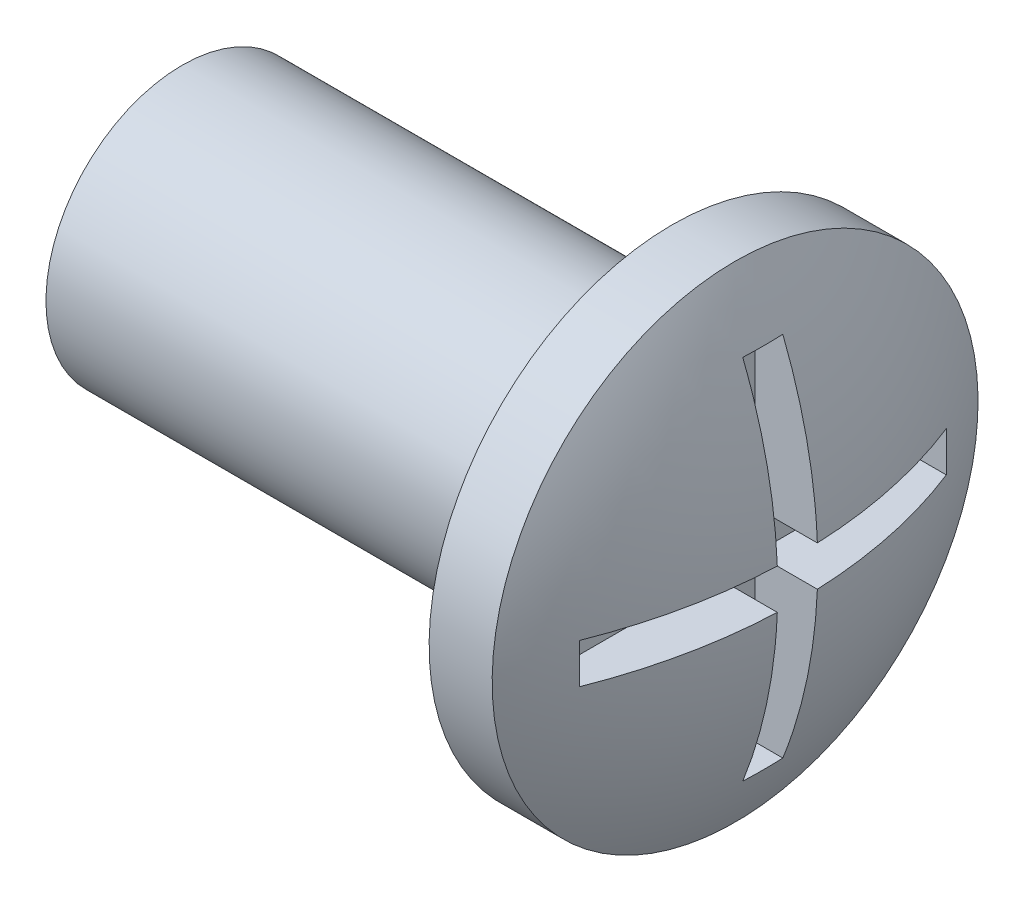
ISO-10303-21;
HEADER;
FILE_DESCRIPTION(('STEP AP214'),'2;1');
FILE_NAME('part.step','',(''),(''),'','','');
FILE_SCHEMA(('AUTOMOTIVE_DESIGN { 1 0 10303 214 1 1 1 1 }'));
ENDSEC;
DATA;
#1=APPLICATION_CONTEXT('core data for automotive mechanical design processes');
#2=APPLICATION_PROTOCOL_DEFINITION('international standard','automotive_design',2000,#1);
#3=PRODUCT_CONTEXT('',#1,'mechanical');
#4=PRODUCT('Part','Part','',(#3));
#5=PRODUCT_RELATED_PRODUCT_CATEGORY('part','',(#4));
#6=PRODUCT_DEFINITION_FORMATION('','',#4);
#7=PRODUCT_DEFINITION_CONTEXT('part definition',#1,'design');
#8=PRODUCT_DEFINITION('design','',#6,#7);
#9=PRODUCT_DEFINITION_SHAPE('','',#8);
#10=(LENGTH_UNIT() NAMED_UNIT(*) SI_UNIT(.MILLI.,.METRE.));
#11=(NAMED_UNIT(*) PLANE_ANGLE_UNIT() SI_UNIT($,.RADIAN.));
#12=(NAMED_UNIT(*) SI_UNIT($,.STERADIAN.) SOLID_ANGLE_UNIT());
#13=UNCERTAINTY_MEASURE_WITH_UNIT(LENGTH_MEASURE(1.E-05),#10,'distance_accuracy_value','');
#14=(GEOMETRIC_REPRESENTATION_CONTEXT(3) GLOBAL_UNCERTAINTY_ASSIGNED_CONTEXT((#13)) GLOBAL_UNIT_ASSIGNED_CONTEXT((#10,
#11,#12)) REPRESENTATION_CONTEXT('',''));
#15=CARTESIAN_POINT('',(0.,0.,0.));
#16=DIRECTION('',(0.,0.,1.));
#17=DIRECTION('',(1.,0.,0.));
#18=AXIS2_PLACEMENT_3D('',#15,#16,#17);
#19=CARTESIAN_POINT('',(3.44990687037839,0.,0.));
#20=DIRECTION('',(1.,0.,0.));
#21=DIRECTION('',(0.,1.,0.));
#22=AXIS2_PLACEMENT_3D('',#19,#20,#21);
#23=PLANE('',#22);
#24=DIRECTION('',(0.,1.,0.));
#25=VECTOR('',#24,1.);
#26=CARTESIAN_POINT('',(3.44990687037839,-0.124979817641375,1.14501266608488));
#27=LINE('',#26,#25);
#28=CARTESIAN_POINT('',(3.44990687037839,0.124979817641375,1.14501266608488));
#29=VERTEX_POINT('',#28);
#30=CARTESIAN_POINT('',(3.44990687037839,-0.124979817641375,1.14501266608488));
#31=VERTEX_POINT('',#30);
#32=EDGE_CURVE('E114',#29,#31,#27,.F.);
#33=ORIENTED_EDGE('',*,*,#32,.T.);
#34=DIRECTION('',(0.,0.,-1.));
#35=VECTOR('',#34,1.);
#36=CARTESIAN_POINT('',(3.44990687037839,-0.124979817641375,0.124979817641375));
#37=LINE('',#36,#35);
#38=CARTESIAN_POINT('',(3.44990687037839,-0.124979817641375,0.124979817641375));
#39=VERTEX_POINT('',#38);
#40=EDGE_CURVE('E116',#31,#39,#37,.T.);
#41=ORIENTED_EDGE('',*,*,#40,.T.);
#42=DIRECTION('',(0.,1.,0.));
#43=VECTOR('',#42,1.);
#44=CARTESIAN_POINT('',(3.44990687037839,-1.14501266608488,0.124979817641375));
#45=LINE('',#44,#43);
#46=CARTESIAN_POINT('',(3.44990687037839,-1.14501266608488,0.124979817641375));
#47=VERTEX_POINT('',#46);
#48=EDGE_CURVE('E118',#39,#47,#45,.F.);
#49=ORIENTED_EDGE('',*,*,#48,.T.);
#50=DIRECTION('',(0.,0.,1.));
#51=VECTOR('',#50,1.);
#52=CARTESIAN_POINT('',(3.44990687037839,-1.14501266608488,-0.124979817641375));
#53=LINE('',#52,#51);
#54=CARTESIAN_POINT('',(3.44990687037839,-1.14501266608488,-0.124979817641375));
#55=VERTEX_POINT('',#54);
#56=EDGE_CURVE('E85',#47,#55,#53,.F.);
#57=ORIENTED_EDGE('',*,*,#56,.T.);
#58=DIRECTION('',(0.,1.,0.));
#59=VECTOR('',#58,1.);
#60=CARTESIAN_POINT('',(3.44990687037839,-0.124979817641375,-0.124979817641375));
#61=LINE('',#60,#59);
#62=CARTESIAN_POINT('',(3.44990687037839,-0.124979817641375,-0.124979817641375));
#63=VERTEX_POINT('',#62);
#64=EDGE_CURVE('E140',#55,#63,#61,.T.);
#65=ORIENTED_EDGE('',*,*,#64,.T.);
#66=DIRECTION('',(0.,0.,-1.));
#67=VECTOR('',#66,1.);
#68=CARTESIAN_POINT('',(3.44990687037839,-0.124979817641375,-1.14501266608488));
#69=LINE('',#68,#67);
#70=CARTESIAN_POINT('',(3.44990687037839,-0.124979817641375,-1.14501266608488));
#71=VERTEX_POINT('',#70);
#72=EDGE_CURVE('E151',#63,#71,#69,.T.);
#73=ORIENTED_EDGE('',*,*,#72,.T.);
#74=DIRECTION('',(0.,1.,0.));
#75=VECTOR('',#74,1.);
#76=CARTESIAN_POINT('',(3.44990687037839,0.124979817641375,-1.14501266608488));
#77=LINE('',#76,#75);
#78=CARTESIAN_POINT('',(3.44990687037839,0.124979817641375,-1.14501266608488));
#79=VERTEX_POINT('',#78);
#80=EDGE_CURVE('E156',#71,#79,#77,.T.);
#81=ORIENTED_EDGE('',*,*,#80,.T.);
#82=DIRECTION('',(0.,0.,1.));
#83=VECTOR('',#82,1.);
#84=CARTESIAN_POINT('',(3.44990687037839,0.124979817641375,-0.124979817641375));
#85=LINE('',#84,#83);
#86=CARTESIAN_POINT('',(3.44990687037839,0.124979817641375,-0.124979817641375));
#87=VERTEX_POINT('',#86);
#88=EDGE_CURVE('E161',#79,#87,#85,.T.);
#89=ORIENTED_EDGE('',*,*,#88,.T.);
#90=DIRECTION('',(0.,1.,0.));
#91=VECTOR('',#90,1.);
#92=CARTESIAN_POINT('',(3.44990687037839,1.14501266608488,-0.124979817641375));
#93=LINE('',#92,#91);
#94=CARTESIAN_POINT('',(3.44990687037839,1.14501266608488,-0.124979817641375));
#95=VERTEX_POINT('',#94);
#96=EDGE_CURVE('E166',#87,#95,#93,.T.);
#97=ORIENTED_EDGE('',*,*,#96,.T.);
#98=DIRECTION('',(0.,0.,1.));
#99=VECTOR('',#98,1.);
#100=CARTESIAN_POINT('',(3.44990687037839,1.14501266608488,0.124979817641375));
#101=LINE('',#100,#99);
#102=CARTESIAN_POINT('',(3.44990687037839,1.14501266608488,0.124979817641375));
#103=VERTEX_POINT('',#102);
#104=EDGE_CURVE('E171',#95,#103,#101,.T.);
#105=ORIENTED_EDGE('',*,*,#104,.T.);
#106=DIRECTION('',(0.,1.,0.));
#107=VECTOR('',#106,1.);
#108=CARTESIAN_POINT('',(3.44990687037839,0.124979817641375,0.124979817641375));
#109=LINE('',#108,#107);
#110=CARTESIAN_POINT('',(3.44990687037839,0.124979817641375,0.124979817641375));
#111=VERTEX_POINT('',#110);
#112=EDGE_CURVE('E176',#103,#111,#109,.F.);
#113=ORIENTED_EDGE('',*,*,#112,.T.);
#114=DIRECTION('',(0.,0.,1.));
#115=VECTOR('',#114,1.);
#116=CARTESIAN_POINT('',(3.44990687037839,0.124979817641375,1.14501266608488));
#117=LINE('',#116,#115);
#118=EDGE_CURVE('E181',#111,#29,#117,.T.);
#119=ORIENTED_EDGE('',*,*,#118,.T.);
#120=EDGE_LOOP('',(#33,#41,#49,#57,#65,#73,#81,#89,#97,#105,#113,#119));
#121=FACE_BOUND('',#120,.T.);
#122=ADVANCED_FACE('F17',(#121),#23,.T.);
#123=CARTESIAN_POINT('',(6.46670566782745,-1.14501266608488,0.124979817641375));
#124=DIRECTION('',(0.,0.,1.));
#125=DIRECTION('',(1.,0.,0.));
#126=AXIS2_PLACEMENT_3D('',#123,#124,#125);
#127=PLANE('',#126);
#128=DIRECTION('',(1.,0.,0.));
#129=VECTOR('',#128,1.);
#130=CARTESIAN_POINT('',(6.46670566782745,-1.14501266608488,0.124979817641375));
#131=LINE('',#130,#129);
#132=CARTESIAN_POINT('',(3.62266873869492,-1.14501266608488,0.124979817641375));
#133=VERTEX_POINT('',#132);
#134=EDGE_CURVE('E126',#133,#47,#131,.F.);
#135=ORIENTED_EDGE('',*,*,#134,.T.);
#136=ORIENTED_EDGE('',*,*,#48,.F.);
#137=DIRECTION('',(1.,0.,0.));
#138=VECTOR('',#137,1.);
#139=CARTESIAN_POINT('',(6.46670566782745,-0.124979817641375,0.124979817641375));
#140=LINE('',#139,#138);
#141=CARTESIAN_POINT('',(3.8382460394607,-0.124979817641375,0.124979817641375));
#142=VERTEX_POINT('',#141);
#143=EDGE_CURVE('E122',#39,#142,#140,.T.);
#144=ORIENTED_EDGE('',*,*,#143,.T.);
#145=CARTESIAN_POINT('',(3.62266873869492,-1.14501266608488,0.124979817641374));
#146=CARTESIAN_POINT('',(3.63881224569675,-1.1041726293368,0.124979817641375));
#147=CARTESIAN_POINT('',(3.65409096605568,-1.06299083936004,0.124979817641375));
#148=CARTESIAN_POINT('',(3.68281814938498,-0.980236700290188,0.124979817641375));
#149=CARTESIAN_POINT('',(3.69627582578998,-0.938667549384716,0.124979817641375));
#150=CARTESIAN_POINT('',(3.72138658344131,-0.855146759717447,0.124979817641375));
#151=CARTESIAN_POINT('',(3.7330458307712,-0.813196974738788,0.124979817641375));
#152=CARTESIAN_POINT('',(3.75457684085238,-0.728920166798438,0.124979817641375));
#153=CARTESIAN_POINT('',(3.76445172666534,-0.686593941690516,0.124979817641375));
#154=CARTESIAN_POINT('',(3.78242195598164,-0.601565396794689,0.124979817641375));
#155=CARTESIAN_POINT('',(3.79051729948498,-0.558863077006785,0.124979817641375));
#156=CARTESIAN_POINT('',(3.80492707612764,-0.473081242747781,0.124979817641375));
#157=CARTESIAN_POINT('',(3.81123833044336,-0.430001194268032,0.124979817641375));
#158=CARTESIAN_POINT('',(3.82206857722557,-0.343462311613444,0.124979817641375));
#159=CARTESIAN_POINT('',(3.82658118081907,-0.300002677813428,0.124979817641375));
#160=CARTESIAN_POINT('',(3.8337940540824,-0.212701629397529,0.124979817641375));
#161=CARTESIAN_POINT('',(3.83648460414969,-0.168859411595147,0.124979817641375));
#162=CARTESIAN_POINT('',(3.8382460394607,-0.124979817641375,0.124979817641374));
#163=B_SPLINE_CURVE_WITH_KNOTS('',3,(#145,#146,#147,#148,#149,#150,#151,#152,#153,#154,#155,
#156,#157,#158,#159,#160,#161,#162),.UNSPECIFIED.,.F.,.F.,(4,2,2,2,2,2,2,2,4),(0.,
0.131734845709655,0.26277605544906,0.39335748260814,0.523708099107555,0.65405871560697,
0.784640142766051,0.915681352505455,1.04741619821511),.UNSPECIFIED.);
#164=EDGE_CURVE('E20',#133,#142,#163,.T.);
#165=ORIENTED_EDGE('',*,*,#164,.F.);
#166=EDGE_LOOP('',(#135,#136,#144,#165));
#167=FACE_BOUND('',#166,.T.);
#168=ADVANCED_FACE('F124',(#167),#127,.F.);
#169=CARTESIAN_POINT('',(6.46670566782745,-0.124979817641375,0.124979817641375));
#170=DIRECTION('',(0.,-1.,0.));
#171=DIRECTION('',(0.,0.,-1.));
#172=AXIS2_PLACEMENT_3D('',#169,#170,#171);
#173=PLANE('',#172);
#174=ORIENTED_EDGE('',*,*,#143,.F.);
#175=ORIENTED_EDGE('',*,*,#40,.F.);
#176=DIRECTION('',(1.,0.,0.));
#177=VECTOR('',#176,1.);
#178=CARTESIAN_POINT('',(6.46670566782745,-0.124979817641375,1.14501266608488));
#179=LINE('',#178,#177);
#180=CARTESIAN_POINT('',(3.62266873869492,-0.124979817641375,1.14501266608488));
#181=VERTEX_POINT('',#180);
#182=EDGE_CURVE('E132',#31,#181,#179,.T.);
#183=ORIENTED_EDGE('',*,*,#182,.T.);
#184=CARTESIAN_POINT('',(0.725887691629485,-0.124979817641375,0.));
#185=DIRECTION('',(0.,1.,0.));
#186=DIRECTION('',(-1.,0.,0.));
#187=AXIS2_PLACEMENT_3D('',#184,#185,#186);
#188=CIRCLE('',#187,3.1148666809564);
#189=EDGE_CURVE('E130',#142,#181,#188,.F.);
#190=ORIENTED_EDGE('',*,*,#189,.F.);
#191=EDGE_LOOP('',(#174,#175,#183,#190));
#192=FACE_BOUND('',#191,.T.);
#193=ADVANCED_FACE('F128',(#192),#173,.F.);
#194=CARTESIAN_POINT('',(6.46670566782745,-0.124979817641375,1.14501266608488));
#195=DIRECTION('',(0.,0.,1.));
#196=DIRECTION('',(1.,0.,0.));
#197=AXIS2_PLACEMENT_3D('',#194,#195,#196);
#198=PLANE('',#197);
#199=ORIENTED_EDGE('',*,*,#182,.F.);
#200=ORIENTED_EDGE('',*,*,#32,.F.);
#201=DIRECTION('',(-1.,0.,0.));
#202=VECTOR('',#201,1.);
#203=CARTESIAN_POINT('',(6.46670566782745,0.124979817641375,1.14501266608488));
#204=LINE('',#203,#202);
#205=CARTESIAN_POINT('',(3.62266873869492,0.124979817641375,1.14501266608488));
#206=VERTEX_POINT('',#205);
#207=EDGE_CURVE('E178',#29,#206,#204,.F.);
#208=ORIENTED_EDGE('',*,*,#207,.T.);
#209=CARTESIAN_POINT('',(3.62266873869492,-0.124979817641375,1.14501266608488));
#210=CARTESIAN_POINT('',(3.62446529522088,-0.0833198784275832,1.14501266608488));
#211=CARTESIAN_POINT('',(3.62536357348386,-0.0416599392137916,1.14501266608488));
#212=CARTESIAN_POINT('',(3.62536357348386,0.0416599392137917,1.14501266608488));
#213=CARTESIAN_POINT('',(3.62446529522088,0.0833198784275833,1.14501266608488));
#214=CARTESIAN_POINT('',(3.62266873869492,0.124979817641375,1.14501266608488));
#215=B_SPLINE_CURVE_WITH_KNOTS('',3,(#209,#210,#211,#212,#213,#214),.UNSPECIFIED.,.F.,.F.,(4,2,
4),(0.,0.125008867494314,0.250017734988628),.UNSPECIFIED.);
#216=EDGE_CURVE('E259',#181,#206,#215,.T.);
#217=ORIENTED_EDGE('',*,*,#216,.F.);
#218=EDGE_LOOP('',(#199,#200,#208,#217));
#219=FACE_BOUND('',#218,.T.);
#220=ADVANCED_FACE('F260',(#219),#198,.F.);
#221=CARTESIAN_POINT('',(6.46670566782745,0.124979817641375,1.14501266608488));
#222=DIRECTION('',(0.,1.,0.));
#223=DIRECTION('',(-1.,0.,0.));
#224=AXIS2_PLACEMENT_3D('',#221,#222,#223);
#225=PLANE('',#224);
#226=ORIENTED_EDGE('',*,*,#207,.F.);
#227=ORIENTED_EDGE('',*,*,#118,.F.);
#228=DIRECTION('',(1.,0.,0.));
#229=VECTOR('',#228,1.);
#230=CARTESIAN_POINT('',(6.46670566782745,0.124979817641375,0.124979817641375));
#231=LINE('',#230,#229);
#232=CARTESIAN_POINT('',(3.8382460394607,0.124979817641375,0.124979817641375));
#233=VERTEX_POINT('',#232);
#234=EDGE_CURVE('E173',#111,#233,#231,.T.);
#235=ORIENTED_EDGE('',*,*,#234,.T.);
#236=CARTESIAN_POINT('',(0.725887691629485,0.124979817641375,0.));
#237=DIRECTION('',(0.,1.,0.));
#238=DIRECTION('',(-1.,0.,0.));
#239=AXIS2_PLACEMENT_3D('',#236,#237,#238);
#240=CIRCLE('',#239,3.1148666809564);
#241=EDGE_CURVE('E265',#206,#233,#240,.T.);
#242=ORIENTED_EDGE('',*,*,#241,.F.);
#243=EDGE_LOOP('',(#226,#227,#235,#242));
#244=FACE_BOUND('',#243,.T.);
#245=ADVANCED_FACE('F276',(#244),#225,.F.);
#246=CARTESIAN_POINT('',(6.46670566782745,0.124979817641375,0.124979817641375));
#247=DIRECTION('',(0.,0.,1.));
#248=DIRECTION('',(1.,0.,0.));
#249=AXIS2_PLACEMENT_3D('',#246,#247,#248);
#250=PLANE('',#249);
#251=ORIENTED_EDGE('',*,*,#234,.F.);
#252=ORIENTED_EDGE('',*,*,#112,.F.);
#253=DIRECTION('',(-1.,0.,0.));
#254=VECTOR('',#253,1.);
#255=CARTESIAN_POINT('',(6.46670566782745,1.14501266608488,0.124979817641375));
#256=LINE('',#255,#254);
#257=CARTESIAN_POINT('',(3.62266873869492,1.14501266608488,0.124979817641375));
#258=VERTEX_POINT('',#257);
#259=EDGE_CURVE('E168',#103,#258,#256,.F.);
#260=ORIENTED_EDGE('',*,*,#259,.T.);
#261=CARTESIAN_POINT('',(3.8382460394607,0.124979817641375,0.124979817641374));
#262=CARTESIAN_POINT('',(3.8364846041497,0.168859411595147,0.124979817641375));
#263=CARTESIAN_POINT('',(3.8337940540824,0.212701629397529,0.124979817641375));
#264=CARTESIAN_POINT('',(3.82658118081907,0.300002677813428,0.124979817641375));
#265=CARTESIAN_POINT('',(3.82206857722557,0.343462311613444,0.124979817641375));
#266=CARTESIAN_POINT('',(3.81123833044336,0.430001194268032,0.124979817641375));
#267=CARTESIAN_POINT('',(3.80492707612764,0.473081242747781,0.124979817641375));
#268=CARTESIAN_POINT('',(3.79051729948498,0.558863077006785,0.124979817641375));
#269=CARTESIAN_POINT('',(3.78242195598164,0.601565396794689,0.124979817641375));
#270=CARTESIAN_POINT('',(3.76445172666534,0.686593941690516,0.124979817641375));
#271=CARTESIAN_POINT('',(3.75457684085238,0.728920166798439,0.124979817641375));
#272=CARTESIAN_POINT('',(3.7330458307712,0.813196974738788,0.124979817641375));
#273=CARTESIAN_POINT('',(3.72138658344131,0.855146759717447,0.124979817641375));
#274=CARTESIAN_POINT('',(3.69627582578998,0.938667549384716,0.124979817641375));
#275=CARTESIAN_POINT('',(3.68281814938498,0.980236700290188,0.124979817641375));
#276=CARTESIAN_POINT('',(3.65409096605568,1.06299083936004,0.124979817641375));
#277=CARTESIAN_POINT('',(3.63881224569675,1.1041726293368,0.124979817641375));
#278=CARTESIAN_POINT('',(3.62266873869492,1.14501266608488,0.124979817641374));
#279=B_SPLINE_CURVE_WITH_KNOTS('',3,(#261,#262,#263,#264,#265,#266,#267,#268,#269,#270,#271,
#272,#273,#274,#275,#276,#277,#278),.UNSPECIFIED.,.F.,.F.,(4,2,2,2,2,2,2,2,4),(0.,
0.131734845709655,0.26277605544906,0.39335748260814,0.523708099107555,0.65405871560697,
0.78464014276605,0.915681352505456,1.04741619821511),.UNSPECIFIED.);
#280=EDGE_CURVE('E448',#233,#258,#279,.T.);
#281=ORIENTED_EDGE('',*,*,#280,.F.);
#282=EDGE_LOOP('',(#251,#252,#260,#281));
#283=FACE_BOUND('',#282,.T.);
#284=ADVANCED_FACE('F366',(#283),#250,.F.);
#285=CARTESIAN_POINT('',(6.46670566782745,1.14501266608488,0.124979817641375));
#286=DIRECTION('',(0.,1.,0.));
#287=DIRECTION('',(-1.,0.,0.));
#288=AXIS2_PLACEMENT_3D('',#285,#286,#287);
#289=PLANE('',#288);
#290=ORIENTED_EDGE('',*,*,#259,.F.);
#291=ORIENTED_EDGE('',*,*,#104,.F.);
#292=DIRECTION('',(1.,0.,0.));
#293=VECTOR('',#292,1.);
#294=CARTESIAN_POINT('',(6.46670566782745,1.14501266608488,-0.124979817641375));
#295=LINE('',#294,#293);
#296=CARTESIAN_POINT('',(3.62266873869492,1.14501266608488,-0.124979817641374));
#297=VERTEX_POINT('',#296);
#298=EDGE_CURVE('E163',#95,#297,#295,.T.);
#299=ORIENTED_EDGE('',*,*,#298,.T.);
#300=CARTESIAN_POINT('',(0.725887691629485,1.14501266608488,0.));
#301=DIRECTION('',(0.,1.,0.));
#302=DIRECTION('',(-1.,0.,0.));
#303=AXIS2_PLACEMENT_3D('',#300,#301,#302);
#304=CIRCLE('',#303,2.89947588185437);
#305=EDGE_CURVE('E449',#258,#297,#304,.T.);
#306=ORIENTED_EDGE('',*,*,#305,.F.);
#307=EDGE_LOOP('',(#290,#291,#299,#306));
#308=FACE_BOUND('',#307,.T.);
#309=ADVANCED_FACE('F358',(#308),#289,.F.);
#310=CARTESIAN_POINT('',(6.46670566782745,1.14501266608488,-0.124979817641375));
#311=DIRECTION('',(0.,0.,-1.));
#312=DIRECTION('',(0.,1.,0.));
#313=AXIS2_PLACEMENT_3D('',#310,#311,#312);
#314=PLANE('',#313);
#315=ORIENTED_EDGE('',*,*,#298,.F.);
#316=ORIENTED_EDGE('',*,*,#96,.F.);
#317=DIRECTION('',(-1.,0.,0.));
#318=VECTOR('',#317,1.);
#319=CARTESIAN_POINT('',(6.46670566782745,0.124979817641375,-0.124979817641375));
#320=LINE('',#319,#318);
#321=CARTESIAN_POINT('',(3.8382460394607,0.124979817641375,-0.124979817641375));
#322=VERTEX_POINT('',#321);
#323=EDGE_CURVE('E158',#87,#322,#320,.F.);
#324=ORIENTED_EDGE('',*,*,#323,.T.);
#325=CARTESIAN_POINT('',(3.62266873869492,1.14501266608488,-0.124979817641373));
#326=CARTESIAN_POINT('',(3.63881224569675,1.1041726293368,-0.124979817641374));
#327=CARTESIAN_POINT('',(3.65409096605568,1.06299083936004,-0.124979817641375));
#328=CARTESIAN_POINT('',(3.68281814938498,0.980236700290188,-0.124979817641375));
#329=CARTESIAN_POINT('',(3.69627582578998,0.938667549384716,-0.124979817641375));
#330=CARTESIAN_POINT('',(3.72138658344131,0.855146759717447,-0.124979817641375));
#331=CARTESIAN_POINT('',(3.7330458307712,0.813196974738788,-0.124979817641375));
#332=CARTESIAN_POINT('',(3.75457684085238,0.728920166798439,-0.124979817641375));
#333=CARTESIAN_POINT('',(3.76445172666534,0.686593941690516,-0.124979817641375));
#334=CARTESIAN_POINT('',(3.78242195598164,0.601565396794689,-0.124979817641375));
#335=CARTESIAN_POINT('',(3.79051729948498,0.558863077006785,-0.124979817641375));
#336=CARTESIAN_POINT('',(3.80492707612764,0.473081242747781,-0.124979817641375));
#337=CARTESIAN_POINT('',(3.81123833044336,0.430001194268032,-0.124979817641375));
#338=CARTESIAN_POINT('',(3.82206857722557,0.343462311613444,-0.124979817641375));
#339=CARTESIAN_POINT('',(3.82658118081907,0.300002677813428,-0.124979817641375));
#340=CARTESIAN_POINT('',(3.8337940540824,0.212701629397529,-0.124979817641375));
#341=CARTESIAN_POINT('',(3.8364846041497,0.168859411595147,-0.124979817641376));
#342=CARTESIAN_POINT('',(3.8382460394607,0.124979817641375,-0.124979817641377));
#343=B_SPLINE_CURVE_WITH_KNOTS('',3,(#325,#326,#327,#328,#329,#330,#331,#332,#333,#334,#335,
#336,#337,#338,#339,#340,#341,#342),.UNSPECIFIED.,.F.,.F.,(4,2,2,2,2,2,2,2,4),(0.,
0.131734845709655,0.26277605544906,0.39335748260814,0.523708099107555,0.65405871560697,
0.784640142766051,0.915681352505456,1.04741619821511),.UNSPECIFIED.);
#344=EDGE_CURVE('E451',#297,#322,#343,.T.);
#345=ORIENTED_EDGE('',*,*,#344,.F.);
#346=EDGE_LOOP('',(#315,#316,#324,#345));
#347=FACE_BOUND('',#346,.T.);
#348=ADVANCED_FACE('F350',(#347),#314,.F.);
#349=CARTESIAN_POINT('',(6.46670566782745,0.124979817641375,-0.124979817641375));
#350=DIRECTION('',(0.,1.,0.));
#351=DIRECTION('',(-1.,0.,0.));
#352=AXIS2_PLACEMENT_3D('',#349,#350,#351);
#353=PLANE('',#352);
#354=ORIENTED_EDGE('',*,*,#323,.F.);
#355=ORIENTED_EDGE('',*,*,#88,.F.);
#356=DIRECTION('',(-1.,0.,0.));
#357=VECTOR('',#356,1.);
#358=CARTESIAN_POINT('',(6.46670566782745,0.124979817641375,-1.14501266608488));
#359=LINE('',#358,#357);
#360=CARTESIAN_POINT('',(3.62266873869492,0.124979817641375,-1.14501266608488));
#361=VERTEX_POINT('',#360);
#362=EDGE_CURVE('E153',#79,#361,#359,.F.);
#363=ORIENTED_EDGE('',*,*,#362,.T.);
#364=CARTESIAN_POINT('',(0.725887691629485,0.124979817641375,0.));
#365=DIRECTION('',(0.,1.,0.));
#366=DIRECTION('',(-1.,0.,0.));
#367=AXIS2_PLACEMENT_3D('',#364,#365,#366);
#368=CIRCLE('',#367,3.1148666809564);
#369=EDGE_CURVE('E464',#322,#361,#368,.T.);
#370=ORIENTED_EDGE('',*,*,#369,.F.);
#371=EDGE_LOOP('',(#354,#355,#363,#370));
#372=FACE_BOUND('',#371,.T.);
#373=ADVANCED_FACE('F342',(#372),#353,.F.);
#374=CARTESIAN_POINT('',(6.46670566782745,0.124979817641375,-1.14501266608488));
#375=DIRECTION('',(0.,0.,-1.));
#376=DIRECTION('',(-1.,0.,0.));
#377=AXIS2_PLACEMENT_3D('',#374,#375,#376);
#378=PLANE('',#377);
#379=ORIENTED_EDGE('',*,*,#362,.F.);
#380=ORIENTED_EDGE('',*,*,#80,.F.);
#381=DIRECTION('',(1.,0.,0.));
#382=VECTOR('',#381,1.);
#383=CARTESIAN_POINT('',(6.46670566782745,-0.124979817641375,-1.14501266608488));
#384=LINE('',#383,#382);
#385=CARTESIAN_POINT('',(3.62266873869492,-0.124979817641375,-1.14501266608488));
#386=VERTEX_POINT('',#385);
#387=EDGE_CURVE('E143',#71,#386,#384,.T.);
#388=ORIENTED_EDGE('',*,*,#387,.T.);
#389=CARTESIAN_POINT('',(3.62266873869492,0.124979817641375,-1.14501266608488));
#390=CARTESIAN_POINT('',(3.62446529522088,0.0833198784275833,-1.14501266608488));
#391=CARTESIAN_POINT('',(3.62536357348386,0.0416599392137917,-1.14501266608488));
#392=CARTESIAN_POINT('',(3.62536357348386,-0.0416599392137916,-1.14501266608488));
#393=CARTESIAN_POINT('',(3.62446529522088,-0.0833198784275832,-1.14501266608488));
#394=CARTESIAN_POINT('',(3.62266873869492,-0.124979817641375,-1.14501266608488));
#395=B_SPLINE_CURVE_WITH_KNOTS('',3,(#389,#390,#391,#392,#393,#394),.UNSPECIFIED.,.F.,.F.,(4,2,
4),(0.,0.125008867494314,0.250017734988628),.UNSPECIFIED.);
#396=EDGE_CURVE('E466',#361,#386,#395,.T.);
#397=ORIENTED_EDGE('',*,*,#396,.F.);
#398=EDGE_LOOP('',(#379,#380,#388,#397));
#399=FACE_BOUND('',#398,.T.);
#400=ADVANCED_FACE('F335',(#399),#378,.F.);
#401=CARTESIAN_POINT('',(6.46670566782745,-0.124979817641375,-1.14501266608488));
#402=DIRECTION('',(0.,-1.,0.));
#403=DIRECTION('',(0.,0.,-1.));
#404=AXIS2_PLACEMENT_3D('',#401,#402,#403);
#405=PLANE('',#404);
#406=ORIENTED_EDGE('',*,*,#387,.F.);
#407=ORIENTED_EDGE('',*,*,#72,.F.);
#408=DIRECTION('',(-1.,0.,0.));
#409=VECTOR('',#408,1.);
#410=CARTESIAN_POINT('',(6.46670566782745,-0.124979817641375,-0.124979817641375));
#411=LINE('',#410,#409);
#412=CARTESIAN_POINT('',(3.8382460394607,-0.124979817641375,-0.124979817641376));
#413=VERTEX_POINT('',#412);
#414=EDGE_CURVE('E142',#63,#413,#411,.F.);
#415=ORIENTED_EDGE('',*,*,#414,.T.);
#416=CARTESIAN_POINT('',(0.725887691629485,-0.124979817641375,0.));
#417=DIRECTION('',(0.,1.,0.));
#418=DIRECTION('',(-1.,0.,0.));
#419=AXIS2_PLACEMENT_3D('',#416,#417,#418);
#420=CIRCLE('',#419,3.1148666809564);
#421=EDGE_CURVE('E207',#386,#413,#420,.F.);
#422=ORIENTED_EDGE('',*,*,#421,.F.);
#423=EDGE_LOOP('',(#406,#407,#415,#422));
#424=FACE_BOUND('',#423,.T.);
#425=ADVANCED_FACE('F329',(#424),#405,.F.);
#426=CARTESIAN_POINT('',(6.46670566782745,-0.124979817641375,-0.124979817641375));
#427=DIRECTION('',(0.,0.,-1.));
#428=DIRECTION('',(-1.,0.,0.));
#429=AXIS2_PLACEMENT_3D('',#426,#427,#428);
#430=PLANE('',#429);
#431=ORIENTED_EDGE('',*,*,#414,.F.);
#432=ORIENTED_EDGE('',*,*,#64,.F.);
#433=DIRECTION('',(1.,0.,0.));
#434=VECTOR('',#433,1.);
#435=CARTESIAN_POINT('',(6.46670566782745,-1.14501266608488,-0.124979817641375));
#436=LINE('',#435,#434);
#437=CARTESIAN_POINT('',(3.62266873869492,-1.14501266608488,-0.124979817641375));
#438=VERTEX_POINT('',#437);
#439=EDGE_CURVE('E39',#55,#438,#436,.T.);
#440=ORIENTED_EDGE('',*,*,#439,.T.);
#441=CARTESIAN_POINT('',(3.8382460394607,-0.124979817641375,-0.124979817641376));
#442=CARTESIAN_POINT('',(3.83648460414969,-0.168859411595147,-0.124979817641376));
#443=CARTESIAN_POINT('',(3.8337940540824,-0.212701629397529,-0.124979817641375));
#444=CARTESIAN_POINT('',(3.82658118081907,-0.300002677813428,-0.124979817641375));
#445=CARTESIAN_POINT('',(3.82206857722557,-0.343462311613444,-0.124979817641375));
#446=CARTESIAN_POINT('',(3.81123833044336,-0.430001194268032,-0.124979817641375));
#447=CARTESIAN_POINT('',(3.80492707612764,-0.473081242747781,-0.124979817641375));
#448=CARTESIAN_POINT('',(3.79051729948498,-0.558863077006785,-0.124979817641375));
#449=CARTESIAN_POINT('',(3.78242195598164,-0.601565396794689,-0.124979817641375));
#450=CARTESIAN_POINT('',(3.76445172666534,-0.686593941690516,-0.124979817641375));
#451=CARTESIAN_POINT('',(3.75457684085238,-0.728920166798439,-0.124979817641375));
#452=CARTESIAN_POINT('',(3.7330458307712,-0.813196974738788,-0.124979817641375));
#453=CARTESIAN_POINT('',(3.72138658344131,-0.855146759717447,-0.124979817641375));
#454=CARTESIAN_POINT('',(3.69627582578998,-0.938667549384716,-0.124979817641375));
#455=CARTESIAN_POINT('',(3.68281814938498,-0.980236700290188,-0.124979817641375));
#456=CARTESIAN_POINT('',(3.65409096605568,-1.06299083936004,-0.124979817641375));
#457=CARTESIAN_POINT('',(3.63881224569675,-1.1041726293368,-0.124979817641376));
#458=CARTESIAN_POINT('',(3.62266873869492,-1.14501266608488,-0.124979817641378));
#459=B_SPLINE_CURVE_WITH_KNOTS('',3,(#441,#442,#443,#444,#445,#446,#447,#448,#449,#450,#451,
#452,#453,#454,#455,#456,#457,#458),.UNSPECIFIED.,.F.,.F.,(4,2,2,2,2,2,2,2,4),(0.,
0.131734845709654,0.26277605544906,0.39335748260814,0.523708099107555,0.65405871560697,
0.78464014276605,0.915681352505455,1.04741619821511),.UNSPECIFIED.);
#460=EDGE_CURVE('E200',#413,#438,#459,.T.);
#461=ORIENTED_EDGE('',*,*,#460,.F.);
#462=EDGE_LOOP('',(#431,#432,#440,#461));
#463=FACE_BOUND('',#462,.T.);
#464=ADVANCED_FACE('F209',(#463),#430,.F.);
#465=CARTESIAN_POINT('',(6.46670566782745,-1.14501266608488,-0.124979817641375));
#466=DIRECTION('',(0.,-1.,0.));
#467=DIRECTION('',(1.,0.,0.));
#468=AXIS2_PLACEMENT_3D('',#465,#466,#467);
#469=PLANE('',#468);
#470=ORIENTED_EDGE('',*,*,#439,.F.);
#471=ORIENTED_EDGE('',*,*,#56,.F.);
#472=ORIENTED_EDGE('',*,*,#134,.F.);
#473=CARTESIAN_POINT('',(0.725887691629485,-1.14501266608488,0.));
#474=DIRECTION('',(0.,1.,0.));
#475=DIRECTION('',(-1.,0.,0.));
#476=AXIS2_PLACEMENT_3D('',#473,#474,#475);
#477=CIRCLE('',#476,2.89947588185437);
#478=EDGE_CURVE('E197',#438,#133,#477,.F.);
#479=ORIENTED_EDGE('',*,*,#478,.F.);
#480=EDGE_LOOP('',(#470,#471,#472,#479));
#481=FACE_BOUND('',#480,.T.);
#482=ADVANCED_FACE('F219',(#481),#469,.F.);
#483=CARTESIAN_POINT('',(0.725887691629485,0.,0.));
#484=DIRECTION('',(0.,1.,0.));
#485=DIRECTION('',(0.,0.,-1.));
#486=AXIS2_PLACEMENT_3D('',#483,#484,#485);
#487=SPHERICAL_SURFACE('',#486,3.11737299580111);
#488=CARTESIAN_POINT('',(3.44990687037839,0.,0.));
#489=DIRECTION('',(1.,0.,0.));
#490=DIRECTION('',(0.,1.,0.));
#491=AXIS2_PLACEMENT_3D('',#488,#489,#490);
#492=CIRCLE('',#491,1.51582779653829);
#493=CARTESIAN_POINT('',(3.44990687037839,1.51582779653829,0.));
#494=VERTEX_POINT('',#493);
#495=EDGE_CURVE('E194',#494,#494,#492,.F.);
#496=ORIENTED_EDGE('',*,*,#495,.F.);
#497=EDGE_LOOP('',(#496));
#498=FACE_BOUND('',#497,.T.);
#499=ORIENTED_EDGE('',*,*,#460,.T.);
#500=ORIENTED_EDGE('',*,*,#478,.T.);
#501=ORIENTED_EDGE('',*,*,#164,.T.);
#502=ORIENTED_EDGE('',*,*,#189,.T.);
#503=ORIENTED_EDGE('',*,*,#216,.T.);
#504=ORIENTED_EDGE('',*,*,#241,.T.);
#505=ORIENTED_EDGE('',*,*,#280,.T.);
#506=ORIENTED_EDGE('',*,*,#305,.T.);
#507=ORIENTED_EDGE('',*,*,#344,.T.);
#508=ORIENTED_EDGE('',*,*,#369,.T.);
#509=ORIENTED_EDGE('',*,*,#396,.T.);
#510=ORIENTED_EDGE('',*,*,#421,.T.);
#511=EDGE_LOOP('',(#499,#500,#501,#502,#503,#504,#505,#506,#507,#508,#509,#510));
#512=FACE_BOUND('',#511,.T.);
#513=ADVANCED_FACE('F213',(#498,#512),#487,.T.);
#514=CARTESIAN_POINT('',(4.22758675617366,0.,0.));
#515=DIRECTION('',(1.,0.,0.));
#516=DIRECTION('',(0.,1.,0.));
#517=AXIS2_PLACEMENT_3D('',#514,#515,#516);
#518=CYLINDRICAL_SURFACE('',#517,1.51582779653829);
#519=CARTESIAN_POINT('',(3.05655305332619,0.,0.));
#520=DIRECTION('',(1.,0.,0.));
#521=DIRECTION('',(0.,1.,0.));
#522=AXIS2_PLACEMENT_3D('',#519,#520,#521);
#523=CIRCLE('',#522,1.51582779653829);
#524=CARTESIAN_POINT('',(3.05655305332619,1.51582779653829,0.));
#525=VERTEX_POINT('',#524);
#526=EDGE_CURVE('E191',#525,#525,#523,.F.);
#527=ORIENTED_EDGE('',*,*,#526,.F.);
#528=EDGE_LOOP('',(#527));
#529=FACE_BOUND('',#528,.T.);
#530=ORIENTED_EDGE('',*,*,#495,.T.);
#531=EDGE_LOOP('',(#530));
#532=FACE_BOUND('',#531,.T.);
#533=ADVANCED_FACE('F218',(#529,#532),#518,.T.);
#534=CARTESIAN_POINT('',(3.05655305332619,0.85,0.));
#535=DIRECTION('',(-1.,0.,0.));
#536=DIRECTION('',(0.,-1.,0.));
#537=AXIS2_PLACEMENT_3D('',#534,#535,#536);
#538=PLANE('',#537);
#539=CARTESIAN_POINT('',(3.05655305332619,0.,0.));
#540=DIRECTION('',(1.,0.,0.));
#541=DIRECTION('',(0.,1.,0.));
#542=AXIS2_PLACEMENT_3D('',#539,#540,#541);
#543=CIRCLE('',#542,0.85);
#544=CARTESIAN_POINT('',(3.05655305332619,0.85,0.));
#545=VERTEX_POINT('',#544);
#546=EDGE_CURVE('E30',#545,#545,#543,.F.);
#547=ORIENTED_EDGE('',*,*,#546,.F.);
#548=EDGE_LOOP('',(#547));
#549=FACE_BOUND('',#548,.T.);
#550=ORIENTED_EDGE('',*,*,#526,.T.);
#551=EDGE_LOOP('',(#550));
#552=FACE_BOUND('',#551,.T.);
#553=ADVANCED_FACE('F293',(#549,#552),#538,.T.);
#554=CARTESIAN_POINT('',(0.,0.,0.));
#555=DIRECTION('',(-1.,0.,0.));
#556=DIRECTION('',(0.,-1.,0.));
#557=AXIS2_PLACEMENT_3D('',#554,#555,#556);
#558=PLANE('',#557);
#559=CARTESIAN_POINT('',(0.,0.,0.));
#560=DIRECTION('',(1.,0.,0.));
#561=DIRECTION('',(0.,1.,0.));
#562=AXIS2_PLACEMENT_3D('',#559,#560,#561);
#563=CIRCLE('',#562,0.85);
#564=CARTESIAN_POINT('',(0.,0.85,0.));
#565=VERTEX_POINT('',#564);
#566=EDGE_CURVE('E11',#565,#565,#563,.T.);
#567=ORIENTED_EDGE('',*,*,#566,.F.);
#568=EDGE_LOOP('',(#567));
#569=FACE_BOUND('',#568,.T.);
#570=ADVANCED_FACE('F287',(#569),#558,.T.);
#571=CARTESIAN_POINT('',(4.22758675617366,0.,0.));
#572=DIRECTION('',(1.,0.,0.));
#573=DIRECTION('',(0.,1.,0.));
#574=AXIS2_PLACEMENT_3D('',#571,#572,#573);
#575=CYLINDRICAL_SURFACE('',#574,0.85);
#576=ORIENTED_EDGE('',*,*,#566,.T.);
#577=EDGE_LOOP('',(#576));
#578=FACE_BOUND('',#577,.T.);
#579=ORIENTED_EDGE('',*,*,#546,.T.);
#580=EDGE_LOOP('',(#579));
#581=FACE_BOUND('',#580,.T.);
#582=ADVANCED_FACE('F285',(#578,#581),#575,.T.);
#583=CLOSED_SHELL('',(#122,#168,#193,#220,#245,#284,#309,#348,#373,#400,#425,#464,#482,#513,
#533,#553,#570,#582));
#584=MANIFOLD_SOLID_BREP('B1',#583);
#585=ADVANCED_BREP_SHAPE_REPRESENTATION('',(#18,#584),#14);
#586=SHAPE_DEFINITION_REPRESENTATION(#9,#585);
ENDSEC;
END-ISO-10303-21;
